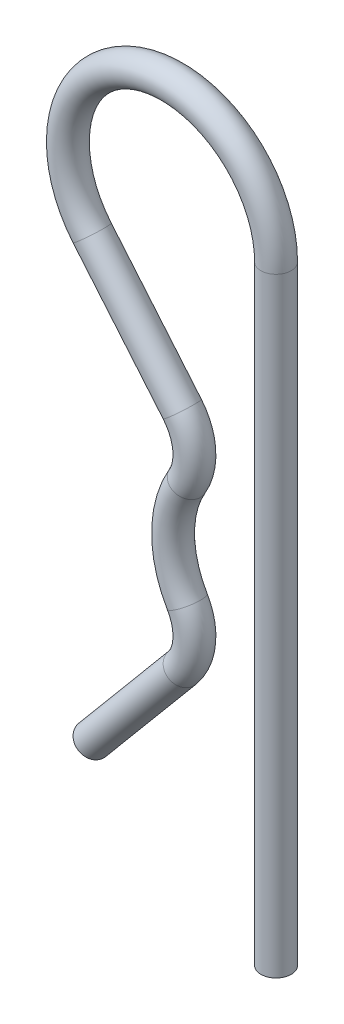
ISO-10303-21;
HEADER;
FILE_DESCRIPTION(('STEP AP214'),'2;1');
FILE_NAME('part.step','',(''),(''),'','','');
FILE_SCHEMA(('AUTOMOTIVE_DESIGN { 1 0 10303 214 1 1 1 1 }'));
ENDSEC;
DATA;
#1=APPLICATION_CONTEXT('core data for automotive mechanical design processes');
#2=APPLICATION_PROTOCOL_DEFINITION('international standard','automotive_design',2000,#1);
#3=PRODUCT_CONTEXT('',#1,'mechanical');
#4=PRODUCT('Part','Part','',(#3));
#5=PRODUCT_RELATED_PRODUCT_CATEGORY('part','',(#4));
#6=PRODUCT_DEFINITION_FORMATION('','',#4);
#7=PRODUCT_DEFINITION_CONTEXT('part definition',#1,'design');
#8=PRODUCT_DEFINITION('design','',#6,#7);
#9=PRODUCT_DEFINITION_SHAPE('','',#8);
#10=(LENGTH_UNIT() NAMED_UNIT(*) SI_UNIT(.MILLI.,.METRE.));
#11=(NAMED_UNIT(*) PLANE_ANGLE_UNIT() SI_UNIT($,.RADIAN.));
#12=(NAMED_UNIT(*) SI_UNIT($,.STERADIAN.) SOLID_ANGLE_UNIT());
#13=UNCERTAINTY_MEASURE_WITH_UNIT(LENGTH_MEASURE(1.E-05),#10,'distance_accuracy_value','');
#14=(GEOMETRIC_REPRESENTATION_CONTEXT(3) GLOBAL_UNCERTAINTY_ASSIGNED_CONTEXT((#13)) GLOBAL_UNIT_ASSIGNED_CONTEXT((#10,
#11,#12)) REPRESENTATION_CONTEXT('',''));
#15=CARTESIAN_POINT('',(0.,0.,0.));
#16=DIRECTION('',(0.,0.,1.));
#17=DIRECTION('',(1.,0.,0.));
#18=AXIS2_PLACEMENT_3D('',#15,#16,#17);
#19=CARTESIAN_POINT('',(-10.8126869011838,-12.9074175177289,0.));
#20=DIRECTION('',(-0.64216277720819,-0.766568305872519,0.));
#21=DIRECTION('',(0.76656830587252,-0.64216277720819,0.));
#22=AXIS2_PLACEMENT_3D('',#19,#20,#21);
#23=CYLINDRICAL_SURFACE('',#22,1.75);
#24=CARTESIAN_POINT('',(-10.8126869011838,-12.9074175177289,0.));
#25=DIRECTION('',(-0.642162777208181,-0.766568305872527,0.));
#26=DIRECTION('',(0.,0.,1.));
#27=AXIS2_PLACEMENT_3D('',#24,#25,#26);
#28=CIRCLE('',#27,1.75);
#29=CARTESIAN_POINT('',(-9.47119236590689,-14.0312023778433,0.));
#30=VERTEX_POINT('',#29);
#31=EDGE_CURVE('E36',#30,#30,#28,.T.);
#32=ORIENTED_EDGE('',*,*,#31,.T.);
#33=EDGE_LOOP('',(#32));
#34=FACE_BOUND('',#33,.T.);
#35=CARTESIAN_POINT('',(-21.1988196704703,-25.3056450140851,0.));
#36=DIRECTION('',(-0.642162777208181,-0.766568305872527,0.));
#37=DIRECTION('',(0.,0.,1.));
#38=AXIS2_PLACEMENT_3D('',#35,#36,#37);
#39=CIRCLE('',#38,1.75);
#40=CARTESIAN_POINT('',(-21.1988196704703,-25.3056450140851,1.75));
#41=VERTEX_POINT('',#40);
#42=EDGE_CURVE('E10',#41,#41,#39,.T.);
#43=ORIENTED_EDGE('',*,*,#42,.F.);
#44=EDGE_LOOP('',(#43));
#45=FACE_BOUND('',#44,.T.);
#46=ADVANCED_FACE('F30',(#34,#45),#23,.T.);
#47=CARTESIAN_POINT('',(-15.4120967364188,-9.05444085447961,0.));
#48=DIRECTION('',(0.,0.,-1.));
#49=DIRECTION('',(-1.,0.,0.));
#50=AXIS2_PLACEMENT_3D('',#47,#48,#49);
#51=TOROIDAL_SURFACE('',#50,6.00000000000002,1.75);
#52=CARTESIAN_POINT('',(-10.2388055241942,-6.01518798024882,0.));
#53=DIRECTION('',(0.506542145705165,-0.862215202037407,0.));
#54=DIRECTION('',(0.,0.,1.));
#55=AXIS2_PLACEMENT_3D('',#52,#53,#54);
#56=CIRCLE('',#55,1.75);
#57=CARTESIAN_POINT('',(-8.72992892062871,-5.12873922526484,0.));
#58=VERTEX_POINT('',#57);
#59=EDGE_CURVE('E40',#58,#58,#56,.T.);
#60=CARTESIAN_POINT('',(-15.4120967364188,-9.05444085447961,0.));
#61=DIRECTION('',(0.,0.,-1.));
#62=DIRECTION('',(-1.,0.,0.));
#63=AXIS2_PLACEMENT_3D('',#60,#61,#62);
#64=CIRCLE('',#63,7.75000000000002);
#65=EDGE_CURVE('',#58,#30,#64,.T.);
#66=ORIENTED_EDGE('',*,*,#59,.T.);
#67=ORIENTED_EDGE('',*,*,#31,.F.);
#68=ORIENTED_EDGE('',*,*,#65,.T.);
#69=ORIENTED_EDGE('',*,*,#65,.F.);
#70=EDGE_LOOP('',(#66,#68,#67,#69));
#71=FACE_BOUND('',#70,.T.);
#72=ADVANCED_FACE('F80',(#71),#51,.T.);
#73=CARTESIAN_POINT('',(0.,0.,0.));
#74=DIRECTION('',(0.,0.,1.));
#75=DIRECTION('',(1.,0.,0.));
#76=AXIS2_PLACEMENT_3D('',#73,#74,#75);
#77=TOROIDAL_SURFACE('',#76,11.875,1.75);
#78=CARTESIAN_POINT('',(-10.2388055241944,6.01518798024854,0.));
#79=DIRECTION('',(-0.50654214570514,-0.862215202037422,0.));
#80=DIRECTION('',(0.,0.,1.));
#81=AXIS2_PLACEMENT_3D('',#78,#79,#80);
#82=CIRCLE('',#81,1.75);
#83=CARTESIAN_POINT('',(-8.72992892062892,5.12873922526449,0.));
#84=VERTEX_POINT('',#83);
#85=EDGE_CURVE('E44',#84,#84,#82,.T.);
#86=ORIENTED_EDGE('',*,*,#85,.T.);
#87=EDGE_LOOP('',(#86));
#88=FACE_BOUND('',#87,.T.);
#89=ORIENTED_EDGE('',*,*,#59,.F.);
#90=EDGE_LOOP('',(#89));
#91=FACE_BOUND('',#90,.T.);
#92=ADVANCED_FACE('F84',(#88,#91),#77,.T.);
#93=CARTESIAN_POINT('',(-15.4120967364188,9.05444085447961,0.));
#94=DIRECTION('',(0.,0.,-1.));
#95=DIRECTION('',(-1.,0.,0.));
#96=AXIS2_PLACEMENT_3D('',#93,#94,#95);
#97=TOROIDAL_SURFACE('',#96,6.00000000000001,1.75);
#98=CARTESIAN_POINT('',(-10.8126869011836,12.9074175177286,0.));
#99=DIRECTION('',(0.642162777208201,-0.76656830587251,0.));
#100=DIRECTION('',(0.,0.,1.));
#101=AXIS2_PLACEMENT_3D('',#98,#99,#100);
#102=CIRCLE('',#101,1.75);
#103=CARTESIAN_POINT('',(-9.47119236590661,14.0312023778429,0.));
#104=VERTEX_POINT('',#103);
#105=EDGE_CURVE('E49',#104,#104,#102,.T.);
#106=CARTESIAN_POINT('',(-15.4120967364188,9.05444085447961,0.));
#107=DIRECTION('',(0.,0.,-1.));
#108=DIRECTION('',(-1.,0.,0.));
#109=AXIS2_PLACEMENT_3D('',#106,#107,#108);
#110=CIRCLE('',#109,7.75000000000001);
#111=EDGE_CURVE('',#104,#84,#110,.T.);
#112=ORIENTED_EDGE('',*,*,#105,.T.);
#113=ORIENTED_EDGE('',*,*,#85,.F.);
#114=ORIENTED_EDGE('',*,*,#111,.T.);
#115=ORIENTED_EDGE('',*,*,#111,.F.);
#116=EDGE_LOOP('',(#112,#114,#113,#115));
#117=FACE_BOUND('',#116,.T.);
#118=ADVANCED_FACE('F90',(#117),#97,.T.);
#119=CARTESIAN_POINT('',(-21.1988196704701,25.3056450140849,0.));
#120=DIRECTION('',(0.64216277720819,-0.766568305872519,0.));
#121=DIRECTION('',(0.766568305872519,0.64216277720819,0.));
#122=AXIS2_PLACEMENT_3D('',#119,#120,#121);
#123=CYLINDRICAL_SURFACE('',#122,1.75);
#124=CARTESIAN_POINT('',(-21.1988196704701,25.3056450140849,0.));
#125=DIRECTION('',(0.642162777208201,-0.76656830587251,0.));
#126=DIRECTION('',(0.,0.,1.));
#127=AXIS2_PLACEMENT_3D('',#124,#125,#126);
#128=CIRCLE('',#127,1.75);
#129=CARTESIAN_POINT('',(-22.540314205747,24.1818601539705,0.));
#130=VERTEX_POINT('',#129);
#131=EDGE_CURVE('E52',#130,#130,#128,.T.);
#132=ORIENTED_EDGE('',*,*,#131,.T.);
#133=EDGE_LOOP('',(#132));
#134=FACE_BOUND('',#133,.T.);
#135=ORIENTED_EDGE('',*,*,#105,.F.);
#136=EDGE_LOOP('',(#135));
#137=FACE_BOUND('',#136,.T.);
#138=ADVANCED_FACE('F97',(#134,#137),#123,.T.);
#139=CARTESIAN_POINT('',(-12.,33.0115983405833,0.));
#140=DIRECTION('',(0.,0.,1.));
#141=DIRECTION('',(1.,0.,0.));
#142=AXIS2_PLACEMENT_3D('',#139,#140,#141);
#143=TOROIDAL_SURFACE('',#142,12.,1.75);
#144=CARTESIAN_POINT('',(0.,33.0115983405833,0.));
#145=DIRECTION('',(0.,1.,0.));
#146=DIRECTION('',(0.,0.,1.));
#147=AXIS2_PLACEMENT_3D('',#144,#145,#146);
#148=CIRCLE('',#147,1.75);
#149=CARTESIAN_POINT('',(1.75,33.0115983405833,0.));
#150=VERTEX_POINT('',#149);
#151=EDGE_CURVE('E55',#150,#150,#148,.T.);
#152=CARTESIAN_POINT('',(-12.,33.0115983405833,0.));
#153=DIRECTION('',(0.,0.,1.));
#154=DIRECTION('',(1.,0.,0.));
#155=AXIS2_PLACEMENT_3D('',#152,#153,#154);
#156=CIRCLE('',#155,13.75);
#157=EDGE_CURVE('',#150,#130,#156,.T.);
#158=ORIENTED_EDGE('',*,*,#151,.T.);
#159=ORIENTED_EDGE('',*,*,#131,.F.);
#160=ORIENTED_EDGE('',*,*,#157,.T.);
#161=ORIENTED_EDGE('',*,*,#157,.F.);
#162=EDGE_LOOP('',(#158,#160,#159,#161));
#163=FACE_BOUND('',#162,.T.);
#164=ADVANCED_FACE('F62',(#163),#143,.T.);
#165=CARTESIAN_POINT('',(0.,33.0115983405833,0.));
#166=DIRECTION('',(0.,-1.,0.));
#167=DIRECTION('',(1.,0.,0.));
#168=AXIS2_PLACEMENT_3D('',#165,#166,#167);
#169=CYLINDRICAL_SURFACE('',#168,1.75);
#170=ORIENTED_EDGE('',*,*,#151,.F.);
#171=EDGE_LOOP('',(#170));
#172=FACE_BOUND('',#171,.T.);
#173=CARTESIAN_POINT('',(0.,-37.2384016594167,0.));
#174=DIRECTION('',(0.,1.,0.));
#175=DIRECTION('',(0.,0.,1.));
#176=AXIS2_PLACEMENT_3D('',#173,#174,#175);
#177=CIRCLE('',#176,1.75);
#178=CARTESIAN_POINT('',(0.,-37.2384016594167,1.75));
#179=VERTEX_POINT('',#178);
#180=EDGE_CURVE('E56',#179,#179,#177,.T.);
#181=ORIENTED_EDGE('',*,*,#180,.T.);
#182=EDGE_LOOP('',(#181));
#183=FACE_BOUND('',#182,.T.);
#184=ADVANCED_FACE('F65',(#172,#183),#169,.T.);
#185=CARTESIAN_POINT('',(-21.1988196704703,-25.3056450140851,0.));
#186=DIRECTION('',(-0.642162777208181,-0.766568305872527,0.));
#187=DIRECTION('',(0.,0.,1.));
#188=AXIS2_PLACEMENT_3D('',#185,#186,#187);
#189=PLANE('',#188);
#190=ORIENTED_EDGE('',*,*,#42,.T.);
#191=EDGE_LOOP('',(#190));
#192=FACE_BOUND('',#191,.T.);
#193=ADVANCED_FACE('F68',(#192),#189,.T.);
#194=CARTESIAN_POINT('',(0.,-37.2384016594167,0.));
#195=DIRECTION('',(0.,1.,0.));
#196=DIRECTION('',(0.,0.,1.));
#197=AXIS2_PLACEMENT_3D('',#194,#195,#196);
#198=PLANE('',#197);
#199=ORIENTED_EDGE('',*,*,#180,.F.);
#200=EDGE_LOOP('',(#199));
#201=FACE_BOUND('',#200,.T.);
#202=ADVANCED_FACE('F72',(#201),#198,.F.);
#203=CLOSED_SHELL('',(#46,#72,#92,#118,#138,#164,#184,#193,#202));
#204=MANIFOLD_SOLID_BREP('B2',#203);
#205=ADVANCED_BREP_SHAPE_REPRESENTATION('',(#18,#204),#14);
#206=SHAPE_DEFINITION_REPRESENTATION(#9,#205);
ENDSEC;
END-ISO-10303-21;
